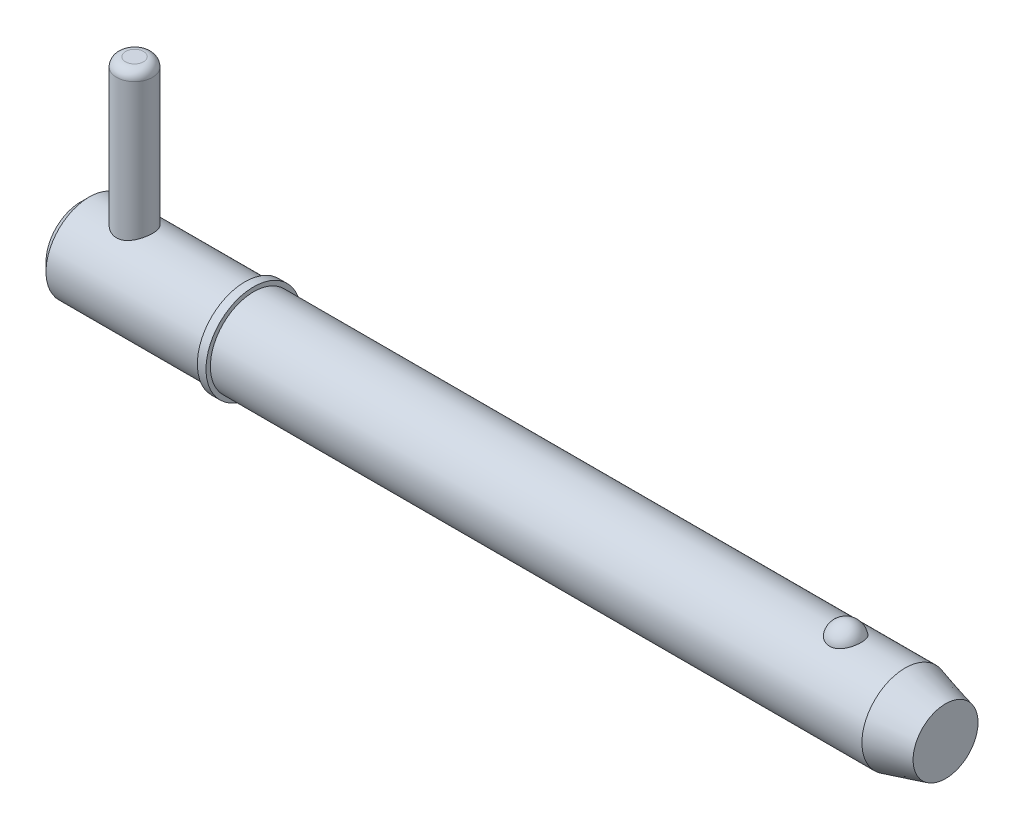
ISO-10303-21;
HEADER;
FILE_DESCRIPTION(('STEP AP214'),'2;1');
FILE_NAME('part.step','',(''),(''),'','','');
FILE_SCHEMA(('AUTOMOTIVE_DESIGN { 1 0 10303 214 1 1 1 1 }'));
ENDSEC;
DATA;
#1=APPLICATION_CONTEXT('core data for automotive mechanical design processes');
#2=APPLICATION_PROTOCOL_DEFINITION('international standard','automotive_design',2000,#1);
#3=PRODUCT_CONTEXT('',#1,'mechanical');
#4=PRODUCT('Part','Part','',(#3));
#5=PRODUCT_RELATED_PRODUCT_CATEGORY('part','',(#4));
#6=PRODUCT_DEFINITION_FORMATION('','',#4);
#7=PRODUCT_DEFINITION_CONTEXT('part definition',#1,'design');
#8=PRODUCT_DEFINITION('design','',#6,#7);
#9=PRODUCT_DEFINITION_SHAPE('','',#8);
#10=(LENGTH_UNIT() NAMED_UNIT(*) SI_UNIT(.MILLI.,.METRE.));
#11=(NAMED_UNIT(*) PLANE_ANGLE_UNIT() SI_UNIT($,.RADIAN.));
#12=(NAMED_UNIT(*) SI_UNIT($,.STERADIAN.) SOLID_ANGLE_UNIT());
#13=UNCERTAINTY_MEASURE_WITH_UNIT(LENGTH_MEASURE(1.E-05),#10,'distance_accuracy_value','');
#14=(GEOMETRIC_REPRESENTATION_CONTEXT(3) GLOBAL_UNCERTAINTY_ASSIGNED_CONTEXT((#13)) GLOBAL_UNIT_ASSIGNED_CONTEXT((#10,
#11,#12)) REPRESENTATION_CONTEXT('',''));
#15=CARTESIAN_POINT('',(0.,0.,0.));
#16=DIRECTION('',(0.,0.,1.));
#17=DIRECTION('',(1.,0.,0.));
#18=AXIS2_PLACEMENT_3D('',#15,#16,#17);
#19=CARTESIAN_POINT('',(5.94,20.635,0.));
#20=DIRECTION('',(0.,-1.,0.));
#21=DIRECTION('',(0.,0.,-1.));
#22=AXIS2_PLACEMENT_3D('',#19,#20,#21);
#23=CYLINDRICAL_SURFACE('',#22,1.98);
#24=CARTESIAN_POINT('',(5.94,-3.775,0.));
#25=DIRECTION('',(0.,1.,0.));
#26=DIRECTION('',(0.,0.,1.));
#27=AXIS2_PLACEMENT_3D('',#24,#25,#26);
#28=CIRCLE('',#27,1.98);
#29=CARTESIAN_POINT('',(5.94,-3.775,1.98));
#30=VERTEX_POINT('',#29);
#31=EDGE_CURVE('P0_E25',#30,#30,#28,.T.);
#32=ORIENTED_EDGE('',*,*,#31,.T.);
#33=EDGE_LOOP('',(#32));
#34=FACE_BOUND('',#33,.T.);
#35=CARTESIAN_POINT('',(5.94,19.645,0.));
#36=DIRECTION('',(0.,1.,0.));
#37=DIRECTION('',(0.,0.,1.));
#38=AXIS2_PLACEMENT_3D('',#35,#36,#37);
#39=CIRCLE('',#38,1.98);
#40=CARTESIAN_POINT('',(5.94,19.645,1.98));
#41=VERTEX_POINT('',#40);
#42=EDGE_CURVE('P0_E29',#41,#41,#39,.F.);
#43=ORIENTED_EDGE('',*,*,#42,.T.);
#44=EDGE_LOOP('',(#43));
#45=FACE_BOUND('',#44,.T.);
#46=ADVANCED_FACE('P0_F14',(#34,#45),#23,.T.);
#47=CARTESIAN_POINT('',(5.94,20.635,0.));
#48=DIRECTION('',(0.,1.,0.));
#49=DIRECTION('',(0.,0.,1.));
#50=AXIS2_PLACEMENT_3D('',#47,#48,#49);
#51=PLANE('',#50);
#52=CARTESIAN_POINT('',(5.94,20.635,0.));
#53=DIRECTION('',(0.,1.,0.));
#54=DIRECTION('',(0.,0.,1.));
#55=AXIS2_PLACEMENT_3D('',#52,#53,#54);
#56=CIRCLE('',#55,0.99);
#57=CARTESIAN_POINT('',(5.94,20.635,0.99));
#58=VERTEX_POINT('',#57);
#59=EDGE_CURVE('P0_E10',#58,#58,#56,.T.);
#60=ORIENTED_EDGE('',*,*,#59,.T.);
#61=EDGE_LOOP('',(#60));
#62=FACE_BOUND('',#61,.T.);
#63=ADVANCED_FACE('P0_F46',(#62),#51,.T.);
#64=CARTESIAN_POINT('',(5.94,-4.765,0.));
#65=DIRECTION('',(0.,1.,0.));
#66=DIRECTION('',(0.,0.,1.));
#67=AXIS2_PLACEMENT_3D('',#64,#65,#66);
#68=PLANE('',#67);
#69=CARTESIAN_POINT('',(5.94,-4.765,0.));
#70=DIRECTION('',(0.,1.,0.));
#71=DIRECTION('',(0.,0.,1.));
#72=AXIS2_PLACEMENT_3D('',#69,#70,#71);
#73=CIRCLE('',#72,0.99);
#74=CARTESIAN_POINT('',(5.94,-4.765,0.99));
#75=VERTEX_POINT('',#74);
#76=EDGE_CURVE('P0_E21',#75,#75,#73,.F.);
#77=ORIENTED_EDGE('',*,*,#76,.T.);
#78=EDGE_LOOP('',(#77));
#79=FACE_BOUND('',#78,.T.);
#80=ADVANCED_FACE('P0_F43',(#79),#68,.F.);
#81=CARTESIAN_POINT('',(5.94,-3.775,0.));
#82=DIRECTION('',(0.,1.,0.));
#83=DIRECTION('',(0.,0.,1.));
#84=AXIS2_PLACEMENT_3D('',#81,#82,#83);
#85=DEGENERATE_TOROIDAL_SURFACE('',#84,0.99,0.99,.T.);
#86=ORIENTED_EDGE('',*,*,#76,.F.);
#87=EDGE_LOOP('',(#86));
#88=FACE_BOUND('',#87,.T.);
#89=ORIENTED_EDGE('',*,*,#31,.F.);
#90=EDGE_LOOP('',(#89));
#91=FACE_BOUND('',#90,.T.);
#92=ADVANCED_FACE('P0_F38',(#88,#91),#85,.T.);
#93=CARTESIAN_POINT('',(5.94,19.645,0.));
#94=DIRECTION('',(0.,1.,0.));
#95=DIRECTION('',(0.,0.,1.));
#96=AXIS2_PLACEMENT_3D('',#93,#94,#95);
#97=DEGENERATE_TOROIDAL_SURFACE('',#96,0.99,0.99,.T.);
#98=ORIENTED_EDGE('',*,*,#42,.F.);
#99=EDGE_LOOP('',(#98));
#100=FACE_BOUND('',#99,.T.);
#101=ORIENTED_EDGE('',*,*,#59,.F.);
#102=EDGE_LOOP('',(#101));
#103=FACE_BOUND('',#102,.T.);
#104=ADVANCED_FACE('P0_F16',(#100,#103),#97,.T.);
#105=CLOSED_SHELL('',(#46,#63,#80,#92,#104));
#106=MANIFOLD_SOLID_BREP('P0_B1',#105);
#107=CARTESIAN_POINT('',(0.,0.,0.));
#108=DIRECTION('',(1.,0.,0.));
#109=DIRECTION('',(0.,0.,-1.));
#110=AXIS2_PLACEMENT_3D('',#107,#108,#109);
#111=CYLINDRICAL_SURFACE('',#110,4.765);
#112=CARTESIAN_POINT('',(90.8041944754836,0.,0.));
#113=DIRECTION('',(1.,0.,0.));
#114=DIRECTION('',(0.,0.,-1.));
#115=AXIS2_PLACEMENT_3D('',#112,#113,#114);
#116=CIRCLE('',#115,4.765);
#117=CARTESIAN_POINT('',(90.8041944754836,0.,-4.765));
#118=VERTEX_POINT('',#117);
#119=EDGE_CURVE('P1_E81',#118,#118,#116,.T.);
#120=ORIENTED_EDGE('',*,*,#119,.F.);
#121=EDGE_LOOP('',(#120));
#122=FACE_BOUND('',#121,.T.);
#123=CARTESIAN_POINT('',(19.05,0.,0.));
#124=DIRECTION('',(1.,0.,0.));
#125=DIRECTION('',(0.,0.,-1.));
#126=AXIS2_PLACEMENT_3D('',#123,#124,#125);
#127=CIRCLE('',#126,4.765);
#128=CARTESIAN_POINT('',(19.05,0.,-4.765));
#129=VERTEX_POINT('',#128);
#130=EDGE_CURVE('P1_E85',#129,#129,#127,.T.);
#131=ORIENTED_EDGE('',*,*,#130,.T.);
#132=EDGE_LOOP('',(#131));
#133=FACE_BOUND('',#132,.T.);
#134=CARTESIAN_POINT('',(84.251020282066,4.42764777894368,1.76101111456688));
#135=CARTESIAN_POINT('',(84.1597212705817,4.42764470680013,1.76101422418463));
#136=CARTESIAN_POINT('',(84.0684468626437,4.43059091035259,1.75366340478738));
#137=CARTESIAN_POINT('',(83.8886154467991,4.44201846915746,1.72451180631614));
#138=CARTESIAN_POINT('',(83.8000577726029,4.45049845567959,1.70271460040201));
#139=CARTESIAN_POINT('',(83.6282570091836,4.47200516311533,1.6453937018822));
#140=CARTESIAN_POINT('',(83.5450064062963,4.48502527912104,1.60988994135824));
#141=CARTESIAN_POINT('',(83.3857633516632,4.51419542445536,1.52617873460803));
#142=CARTESIAN_POINT('',(83.3097723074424,4.53034605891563,1.47796883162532));
#143=CARTESIAN_POINT('',(83.1647445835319,4.5645931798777,1.36860494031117));
#144=CARTESIAN_POINT('',(83.0959645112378,4.58273170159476,1.30712420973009));
#145=CARTESIAN_POINT('',(82.9693423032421,4.61870302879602,1.17370204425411));
#146=CARTESIAN_POINT('',(82.9115021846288,4.63653577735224,1.10175868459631));
#147=CARTESIAN_POINT('',(82.8055709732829,4.67090140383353,0.945806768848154));
#148=CARTESIAN_POINT('',(82.7580305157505,4.68734068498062,0.861402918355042));
#149=CARTESIAN_POINT('',(82.6770817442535,4.71628466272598,0.685442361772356));
#150=CARTESIAN_POINT('',(82.6436747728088,4.72878898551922,0.593884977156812));
#151=CARTESIAN_POINT('',(82.591287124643,4.74874061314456,0.404781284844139));
#152=CARTESIAN_POINT('',(82.5725178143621,4.75611366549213,0.307168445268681));
#153=CARTESIAN_POINT('',(82.5505846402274,4.76475393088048,0.109940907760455));
#154=CARTESIAN_POINT('',(82.5474205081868,4.76602124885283,0.0103262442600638));
#155=CARTESIAN_POINT('',(82.5567405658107,4.76232928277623,-0.187629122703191));
#156=CARTESIAN_POINT('',(82.5691588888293,4.7573962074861,-0.285973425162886));
#157=CARTESIAN_POINT('',(82.6092804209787,4.74184975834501,-0.479027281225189));
#158=CARTESIAN_POINT('',(82.6369839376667,4.7312362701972,-0.573736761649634));
#159=CARTESIAN_POINT('',(82.7071581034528,4.70540026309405,-0.756973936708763));
#160=CARTESIAN_POINT('',(82.7496460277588,4.69017235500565,-0.845494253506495));
#161=CARTESIAN_POINT('',(82.848520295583,4.6566986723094,-1.01378033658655));
#162=CARTESIAN_POINT('',(82.9049076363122,4.63845268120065,-1.09354547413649));
#163=CARTESIAN_POINT('',(83.030552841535,4.60085438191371,-1.24228523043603));
#164=CARTESIAN_POINT('',(83.0998439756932,4.58149930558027,-1.31123108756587));
#165=CARTESIAN_POINT('',(83.2496066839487,4.54391653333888,-1.43607409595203));
#166=CARTESIAN_POINT('',(83.3300771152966,4.52568872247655,-1.49197257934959));
#167=CARTESIAN_POINT('',(83.4981500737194,4.49293007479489,-1.58786764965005));
#168=CARTESIAN_POINT('',(83.5855445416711,4.47832346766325,-1.62820219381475));
#169=CARTESIAN_POINT('',(83.766553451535,4.45406011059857,-1.69345757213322));
#170=CARTESIAN_POINT('',(83.8601655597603,4.44440151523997,-1.71838415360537));
#171=CARTESIAN_POINT('',(84.0458939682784,4.43159888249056,-1.75112843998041));
#172=CARTESIAN_POINT('',(84.137849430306,4.42815213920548,-1.75974223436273));
#173=CARTESIAN_POINT('',(84.3219658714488,4.427247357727,-1.76201865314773));
#174=CARTESIAN_POINT('',(84.4141268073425,4.42978816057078,-1.7556841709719));
#175=CARTESIAN_POINT('',(84.5931292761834,4.4403864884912,-1.72869560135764));
#176=CARTESIAN_POINT('',(84.6800474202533,4.44827555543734,-1.70847853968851));
#177=CARTESIAN_POINT('',(84.8491314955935,4.46852246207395,-1.65479562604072));
#178=CARTESIAN_POINT('',(84.9312970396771,4.48088066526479,-1.62132869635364));
#179=CARTESIAN_POINT('',(85.0905916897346,4.50907357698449,-1.54120560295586));
#180=CARTESIAN_POINT('',(85.1675700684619,4.52497884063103,-1.49427526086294));
#181=CARTESIAN_POINT('',(85.3127080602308,4.55845148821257,-1.38881222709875));
#182=CARTESIAN_POINT('',(85.3808656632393,4.57601924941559,-1.33027689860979));
#183=CARTESIAN_POINT('',(85.5100990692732,4.61196537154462,-1.19991049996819));
#184=CARTESIAN_POINT('',(85.5706562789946,4.63034074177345,-1.12756415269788));
#185=CARTESIAN_POINT('',(85.6792797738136,4.66513959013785,-0.973612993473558));
#186=CARTESIAN_POINT('',(85.7273438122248,4.68156271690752,-0.892006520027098));
#187=CARTESIAN_POINT('',(85.811383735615,4.71130224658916,-0.718892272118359));
#188=CARTESIAN_POINT('',(85.8469185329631,4.724501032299,-0.627149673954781));
#189=CARTESIAN_POINT('',(85.9029522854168,4.74571823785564,-0.438611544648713));
#190=CARTESIAN_POINT('',(85.923450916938,4.75373654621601,-0.341815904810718));
#191=CARTESIAN_POINT('',(85.9490338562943,4.76378905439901,-0.145633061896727));
#192=CARTESIAN_POINT('',(85.954076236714,4.76580697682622,-0.0462395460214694));
#193=CARTESIAN_POINT('',(85.9485239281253,4.76360573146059,0.152038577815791));
#194=CARTESIAN_POINT('',(85.9379294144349,4.75938663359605,0.250923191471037));
#195=CARTESIAN_POINT('',(85.9013875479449,4.74516937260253,0.445004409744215));
#196=CARTESIAN_POINT('',(85.8754964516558,4.73519238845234,0.540213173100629));
#197=CARTESIAN_POINT('',(85.8089273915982,4.7104939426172,0.724662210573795));
#198=CARTESIAN_POINT('',(85.768248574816,4.69577220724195,0.813902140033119));
#199=CARTESIAN_POINT('',(85.6727177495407,4.66303767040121,0.984313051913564));
#200=CARTESIAN_POINT('',(85.6178042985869,4.64501070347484,1.06544688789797));
#201=CARTESIAN_POINT('',(85.4950496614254,4.60764678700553,1.21692673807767));
#202=CARTESIAN_POINT('',(85.4272086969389,4.58830985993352,1.2872729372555));
#203=CARTESIAN_POINT('',(85.2805480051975,4.55060370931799,1.41479271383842));
#204=CARTESIAN_POINT('',(85.2017918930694,4.53222967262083,1.4720378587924));
#205=CARTESIAN_POINT('',(85.0349890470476,4.49849576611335,1.57212016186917));
#206=CARTESIAN_POINT('',(84.9469417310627,4.48313608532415,1.61495641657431));
#207=CARTESIAN_POINT('',(84.7597918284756,4.45676184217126,1.68642657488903));
#208=CARTESIAN_POINT('',(84.6603653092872,4.44598302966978,1.71430590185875));
#209=CARTESIAN_POINT('',(84.4576210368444,4.43142918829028,1.75159258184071));
#210=CARTESIAN_POINT('',(84.3543049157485,4.42765125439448,1.76100759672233));
#211=CARTESIAN_POINT('',(84.251020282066,4.42764777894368,1.76101111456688));
#212=B_SPLINE_CURVE_WITH_KNOTS('',3,(#134,#135,#136,#137,#138,#139,#140,#141,#142,#143,#144,
#145,#146,#147,#148,#149,#150,#151,#152,#153,#154,#155,#156,#157,#158,#159,#160,#161,#162,#163,
#164,#165,#166,#167,#168,#169,#170,#171,#172,#173,#174,#175,#176,#177,#178,#179,#180,#181,#182,
#183,#184,#185,#186,#187,#188,#189,#190,#191,#192,#193,#194,#195,#196,#197,#198,#199,#200,#201,
#202,#203,#204,#205,#206,#207,#208,#209,#210,#211),.UNSPECIFIED.,.T.,.F.,(4,2,2,2,2,2,2,2,2,2,2,
2,2,2,2,2,2,2,2,2,2,2,2,2,2,2,2,2,2,2,2,2,2,2,2,2,2,2,4),(0.,0.273517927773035,
0.546968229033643,0.820022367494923,1.09312934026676,1.37393946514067,1.65480131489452,
1.94820420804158,2.24163496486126,2.53922817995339,2.8368162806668,3.13315071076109,
3.42949110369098,3.72617893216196,4.02288805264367,4.32037303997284,4.61782764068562,
4.90840095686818,5.19886582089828,5.4747485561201,5.75057789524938,6.01809977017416,
6.2856434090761,6.55907787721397,6.83257454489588,7.11962987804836,7.40673679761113,
7.70312663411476,7.99952284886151,8.29672237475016,8.59391856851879,8.89002850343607,
9.18615552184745,9.483582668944,9.78100471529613,10.0767610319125,10.3725358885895,
10.6820893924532,10.991514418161),.UNSPECIFIED.);
#213=CARTESIAN_POINT('',(84.251020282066,4.42764777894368,1.76101111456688));
#214=VERTEX_POINT('',#213);
#215=EDGE_CURVE('P1_E35',#214,#214,#212,.T.);
#216=ORIENTED_EDGE('',*,*,#215,.T.);
#217=EDGE_LOOP('',(#216));
#218=FACE_BOUND('',#217,.T.);
#219=ADVANCED_FACE('P1_F13',(#122,#133,#218),#111,.T.);
#220=CARTESIAN_POINT('',(0.,0.,0.));
#221=DIRECTION('',(-1.,0.,0.));
#222=DIRECTION('',(0.,0.,1.));
#223=AXIS2_PLACEMENT_3D('',#220,#221,#222);
#224=PLANE('',#223);
#225=CARTESIAN_POINT('',(0.,0.,0.));
#226=DIRECTION('',(1.,0.,0.));
#227=DIRECTION('',(0.,0.,-1.));
#228=AXIS2_PLACEMENT_3D('',#225,#226,#227);
#229=CIRCLE('',#228,3.812);
#230=CARTESIAN_POINT('',(0.,0.,-3.812));
#231=VERTEX_POINT('',#230);
#232=EDGE_CURVE('P1_E9',#231,#231,#229,.T.);
#233=ORIENTED_EDGE('',*,*,#232,.F.);
#234=EDGE_LOOP('',(#233));
#235=FACE_BOUND('',#234,.T.);
#236=ADVANCED_FACE('P1_F15',(#235),#224,.T.);
#237=CARTESIAN_POINT('',(0.952999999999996,0.,0.));
#238=DIRECTION('',(1.,0.,0.));
#239=DIRECTION('',(0.,0.,-1.));
#240=AXIS2_PLACEMENT_3D('',#237,#238,#239);
#241=CONICAL_SURFACE('',#240,4.765,0.78539816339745);
#242=ORIENTED_EDGE('',*,*,#232,.T.);
#243=EDGE_LOOP('',(#242));
#244=FACE_BOUND('',#243,.T.);
#245=CARTESIAN_POINT('',(0.952999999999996,0.,0.));
#246=DIRECTION('',(1.,0.,0.));
#247=DIRECTION('',(0.,0.,-1.));
#248=AXIS2_PLACEMENT_3D('',#245,#246,#247);
#249=CIRCLE('',#248,4.765);
#250=CARTESIAN_POINT('',(0.952999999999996,0.,-4.765));
#251=VERTEX_POINT('',#250);
#252=EDGE_CURVE('P1_E26',#251,#251,#249,.T.);
#253=ORIENTED_EDGE('',*,*,#252,.F.);
#254=EDGE_LOOP('',(#253));
#255=FACE_BOUND('',#254,.T.);
#256=ADVANCED_FACE('P1_F77',(#244,#255),#241,.T.);
#257=CARTESIAN_POINT('',(0.,0.,0.));
#258=DIRECTION('',(1.,0.,0.));
#259=DIRECTION('',(0.,0.,-1.));
#260=AXIS2_PLACEMENT_3D('',#257,#258,#259);
#261=CYLINDRICAL_SURFACE('',#260,4.765);
#262=CARTESIAN_POINT('',(5.94,-4.33414639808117,1.98));
#263=CARTESIAN_POINT('',(5.83435484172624,-4.33415447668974,1.97999169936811));
#264=CARTESIAN_POINT('',(5.72854887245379,-4.33806396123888,1.97149330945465));
#265=CARTESIAN_POINT('',(5.51998191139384,-4.35319906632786,1.93783487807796));
#266=CARTESIAN_POINT('',(5.41723000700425,-4.3644446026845,1.91262947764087));
#267=CARTESIAN_POINT('',(5.21817294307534,-4.39274225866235,1.84670269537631));
#268=CARTESIAN_POINT('',(5.12184344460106,-4.40977076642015,1.80604432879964));
#269=CARTESIAN_POINT('',(4.93740039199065,-4.44768106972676,1.71055160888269));
#270=CARTESIAN_POINT('',(4.84928487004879,-4.46856193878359,1.65572066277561));
#271=CARTESIAN_POINT('',(4.67826533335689,-4.51326966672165,1.52981120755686));
#272=CARTESIAN_POINT('',(4.59593118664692,-4.53719608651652,1.45799365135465));
#273=CARTESIAN_POINT('',(4.44405452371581,-4.58448035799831,1.30170177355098));
#274=CARTESIAN_POINT('',(4.37451692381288,-4.60783798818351,1.21722260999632));
#275=CARTESIAN_POINT('',(4.24730683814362,-4.65256187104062,1.03353484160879));
#276=CARTESIAN_POINT('',(4.19027484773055,-4.67379892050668,0.933848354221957));
#277=CARTESIAN_POINT('',(4.0940363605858,-4.7106711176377,0.7252544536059));
#278=CARTESIAN_POINT('',(4.05482199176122,-4.72630873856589,0.61635113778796));
#279=CARTESIAN_POINT('',(3.99739515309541,-4.74951416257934,0.398397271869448));
#280=CARTESIAN_POINT('',(3.97820018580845,-4.7574579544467,0.289646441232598));
#281=CARTESIAN_POINT('',(3.95818309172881,-4.76574596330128,0.0701967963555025));
#282=CARTESIAN_POINT('',(3.95735355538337,-4.76609324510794,-0.0405012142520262));
#283=CARTESIAN_POINT('',(3.9735743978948,-4.75937098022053,-0.253561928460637));
#284=CARTESIAN_POINT('',(3.98954548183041,-4.75274912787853,-0.356023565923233));
#285=CARTESIAN_POINT('',(4.03706504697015,-4.73344665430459,-0.556659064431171));
#286=CARTESIAN_POINT('',(4.06861467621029,-4.72076558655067,-0.654832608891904));
#287=CARTESIAN_POINT('',(4.14677192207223,-4.69032846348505,-0.845904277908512));
#288=CARTESIAN_POINT('',(4.19360181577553,-4.67249797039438,-0.938699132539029));
#289=CARTESIAN_POINT('',(4.30077315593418,-4.63350852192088,-1.11535616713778));
#290=CARTESIAN_POINT('',(4.3611193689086,-4.61234839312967,-1.19921518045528));
#291=CARTESIAN_POINT('',(4.49853487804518,-4.56707259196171,-1.3618711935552));
#292=CARTESIAN_POINT('',(4.57648039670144,-4.5428537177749,-1.43990029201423));
#293=CARTESIAN_POINT('',(4.74440779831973,-4.49530722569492,-1.58211009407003));
#294=CARTESIAN_POINT('',(4.83439425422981,-4.47197995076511,-1.64628551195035));
#295=CARTESIAN_POINT('',(5.02755026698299,-4.42812342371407,-1.76092221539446));
#296=CARTESIAN_POINT('',(5.13105348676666,-4.40770990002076,-1.81086937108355));
#297=CARTESIAN_POINT('',(5.34607555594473,-4.37336901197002,-1.89231211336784));
#298=CARTESIAN_POINT('',(5.45758864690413,-4.3594370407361,-1.92382080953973));
#299=CARTESIAN_POINT('',(5.67777275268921,-4.34077746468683,-1.96554536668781));
#300=CARTESIAN_POINT('',(5.78616167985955,-4.33551319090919,-1.9770057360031));
#301=CARTESIAN_POINT('',(6.00341835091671,-4.33325118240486,-1.98196183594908));
#302=CARTESIAN_POINT('',(6.11228591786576,-4.33625061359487,-1.97546372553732));
#303=CARTESIAN_POINT('',(6.32012423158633,-4.34962383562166,-1.94582288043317));
#304=CARTESIAN_POINT('',(6.41928436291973,-4.35951709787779,-1.92376364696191));
#305=CARTESIAN_POINT('',(6.61241543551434,-4.38495043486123,-1.86506038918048));
#306=CARTESIAN_POINT('',(6.70638516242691,-4.40049182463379,-1.82841296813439));
#307=CARTESIAN_POINT('',(6.89090272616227,-4.43627016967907,-1.73985559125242));
#308=CARTESIAN_POINT('',(6.98113841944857,-4.45667771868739,-1.68736639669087));
#309=CARTESIAN_POINT('',(7.1519532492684,-4.49964530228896,-1.56919282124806));
#310=CARTESIAN_POINT('',(7.232528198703,-4.52220626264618,-1.50350275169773));
#311=CARTESIAN_POINT('',(7.38851617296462,-4.56914071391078,-1.35452895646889));
#312=CARTESIAN_POINT('',(7.46298462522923,-4.5935132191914,-1.27025197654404));
#313=CARTESIAN_POINT('',(7.59689029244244,-4.63962841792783,-1.08983181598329));
#314=CARTESIAN_POINT('',(7.65632644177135,-4.66137092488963,-0.993687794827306));
#315=CARTESIAN_POINT('',(7.75840361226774,-4.69991192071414,-0.791608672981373));
#316=CARTESIAN_POINT('',(7.80100481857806,-4.71669866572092,-0.685651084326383));
#317=CARTESIAN_POINT('',(7.86746997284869,-4.74331408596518,-0.467197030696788));
#318=CARTESIAN_POINT('',(7.8913450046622,-4.75314687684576,-0.354704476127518));
#319=CARTESIAN_POINT('',(7.91828971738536,-4.76427543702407,-0.134819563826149));
#320=CARTESIAN_POINT('',(7.92269147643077,-4.76611762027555,-0.027616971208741));
#321=CARTESIAN_POINT('',(7.91414154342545,-4.76256684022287,0.185959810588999));
#322=CARTESIAN_POINT('',(7.90119286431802,-4.75717513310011,0.292334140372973));
#323=CARTESIAN_POINT('',(7.85926572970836,-4.74004856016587,0.497383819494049));
#324=CARTESIAN_POINT('',(7.83086647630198,-4.72854322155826,0.596198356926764));
#325=CARTESIAN_POINT('',(7.75947503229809,-4.70045111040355,0.787624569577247));
#326=CARTESIAN_POINT('',(7.71648006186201,-4.68386336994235,0.880235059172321));
#327=CARTESIAN_POINT('',(7.6149456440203,-4.64628321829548,1.06122875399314));
#328=CARTESIAN_POINT('',(7.55579211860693,-4.62512577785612,1.14923242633));
#329=CARTESIAN_POINT('',(7.42451813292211,-4.58091700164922,1.31443888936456));
#330=CARTESIAN_POINT('',(7.35239289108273,-4.5578649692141,1.39163767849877));
#331=CARTESIAN_POINT('',(7.19146107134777,-4.51050832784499,1.53847013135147));
#332=CARTESIAN_POINT('',(7.10185635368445,-4.48622440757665,1.60723941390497));
#333=CARTESIAN_POINT('',(6.91164948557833,-4.44076541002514,1.72888900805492));
#334=CARTESIAN_POINT('',(6.81104124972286,-4.41959206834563,1.78176046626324));
#335=CARTESIAN_POINT('',(6.60181953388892,-4.38318936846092,1.86953227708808));
#336=CARTESIAN_POINT('',(6.49325511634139,-4.3679267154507,1.90453365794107));
#337=CARTESIAN_POINT('',(6.32681512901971,-4.35102038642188,1.94268459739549));
#338=CARTESIAN_POINT('',(6.27079191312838,-4.34638447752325,1.953006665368));
#339=CARTESIAN_POINT('',(6.15793999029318,-4.33925923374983,1.96879053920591));
#340=CARTESIAN_POINT('',(6.10111188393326,-4.33676837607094,1.97425579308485));
#341=CARTESIAN_POINT('',(6.00947316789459,-4.33456308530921,1.97908711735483));
#342=CARTESIAN_POINT('',(5.97474528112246,-4.33414374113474,1.98000272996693));
#343=CARTESIAN_POINT('',(5.94,-4.33414639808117,1.98));
#344=B_SPLINE_CURVE_WITH_KNOTS('',3,(#262,#263,#264,#265,#266,#267,#268,#269,#270,#271,#272,
#273,#274,#275,#276,#277,#278,#279,#280,#281,#282,#283,#284,#285,#286,#287,#288,#289,#290,#291,
#292,#293,#294,#295,#296,#297,#298,#299,#300,#301,#302,#303,#304,#305,#306,#307,#308,#309,#310,
#311,#312,#313,#314,#315,#316,#317,#318,#319,#320,#321,#322,#323,#324,#325,#326,#327,#328,#329,
#330,#331,#332,#333,#334,#335,#336,#337,#338,#339,#340,#341,#342,#343),.UNSPECIFIED.,.T.,.F.,(4,
2,2,2,2,2,2,2,2,2,2,2,2,2,2,2,2,2,2,2,2,2,2,2,2,2,2,2,2,2,2,2,2,2,2,2,2,2,2,2,4),(0.,
0.316814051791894,0.634491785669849,0.950887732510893,1.2672076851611,1.60127705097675,
1.93547449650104,2.28407463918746,2.63252061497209,2.96292077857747,3.29318763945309,
3.60346227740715,3.91375978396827,4.22878888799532,4.54392926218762,4.88117914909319,
5.21855748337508,5.56691259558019,5.91501972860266,6.24062939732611,6.56612741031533,
6.87094948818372,7.17584258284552,7.49361276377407,7.81152017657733,8.15513975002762,
8.4987836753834,8.8432355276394,9.18748334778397,9.50777781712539,9.8280166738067,
10.1370037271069,10.4460496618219,10.7690461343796,11.0921619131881,11.4371238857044,
11.7822776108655,12.1254577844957,12.2967183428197,12.4678572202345,12.5720531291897),.UNSPECIFIED.);
#345=CARTESIAN_POINT('',(5.94,-4.33414639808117,1.98));
#346=VERTEX_POINT('',#345);
#347=EDGE_CURVE('P1_E17',#346,#346,#344,.T.);
#348=ORIENTED_EDGE('',*,*,#347,.F.);
#349=EDGE_LOOP('',(#348));
#350=FACE_BOUND('',#349,.T.);
#351=CARTESIAN_POINT('',(5.94,4.33414639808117,1.98));
#352=CARTESIAN_POINT('',(6.04564515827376,4.33415447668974,1.97999169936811));
#353=CARTESIAN_POINT('',(6.15145112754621,4.33806396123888,1.97149330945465));
#354=CARTESIAN_POINT('',(6.36001808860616,4.35319906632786,1.93783487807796));
#355=CARTESIAN_POINT('',(6.46276999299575,4.3644446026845,1.91262947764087));
#356=CARTESIAN_POINT('',(6.66182705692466,4.39274225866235,1.84670269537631));
#357=CARTESIAN_POINT('',(6.75815655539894,4.40977076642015,1.80604432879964));
#358=CARTESIAN_POINT('',(6.94259960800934,4.44768106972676,1.71055160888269));
#359=CARTESIAN_POINT('',(7.03071512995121,4.46856193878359,1.65572066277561));
#360=CARTESIAN_POINT('',(7.20173466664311,4.51326966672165,1.52981120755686));
#361=CARTESIAN_POINT('',(7.28406881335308,4.53719608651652,1.45799365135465));
#362=CARTESIAN_POINT('',(7.43594547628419,4.58448035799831,1.30170177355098));
#363=CARTESIAN_POINT('',(7.50548307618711,4.60783798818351,1.21722260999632));
#364=CARTESIAN_POINT('',(7.63269316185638,4.65256187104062,1.03353484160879));
#365=CARTESIAN_POINT('',(7.68972515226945,4.67379892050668,0.933848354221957));
#366=CARTESIAN_POINT('',(7.7859636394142,4.7106711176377,0.7252544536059));
#367=CARTESIAN_POINT('',(7.82517800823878,4.72630873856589,0.61635113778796));
#368=CARTESIAN_POINT('',(7.88260484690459,4.74951416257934,0.398397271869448));
#369=CARTESIAN_POINT('',(7.90179981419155,4.7574579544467,0.289646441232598));
#370=CARTESIAN_POINT('',(7.92181690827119,4.76574596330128,0.0701967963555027));
#371=CARTESIAN_POINT('',(7.92264644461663,4.76609324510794,-0.040501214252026));
#372=CARTESIAN_POINT('',(7.9064256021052,4.75937098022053,-0.253561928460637));
#373=CARTESIAN_POINT('',(7.89045451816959,4.75274912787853,-0.356023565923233));
#374=CARTESIAN_POINT('',(7.84293495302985,4.73344665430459,-0.55665906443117));
#375=CARTESIAN_POINT('',(7.81138532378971,4.72076558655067,-0.654832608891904));
#376=CARTESIAN_POINT('',(7.73322807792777,4.69032846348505,-0.845904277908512));
#377=CARTESIAN_POINT('',(7.68639818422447,4.67249797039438,-0.938699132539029));
#378=CARTESIAN_POINT('',(7.57922684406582,4.63350852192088,-1.11535616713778));
#379=CARTESIAN_POINT('',(7.5188806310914,4.61234839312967,-1.19921518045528));
#380=CARTESIAN_POINT('',(7.38146512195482,4.56707259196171,-1.3618711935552));
#381=CARTESIAN_POINT('',(7.30351960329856,4.5428537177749,-1.43990029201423));
#382=CARTESIAN_POINT('',(7.13559220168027,4.49530722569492,-1.58211009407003));
#383=CARTESIAN_POINT('',(7.04560574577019,4.47197995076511,-1.64628551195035));
#384=CARTESIAN_POINT('',(6.85244973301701,4.42812342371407,-1.76092221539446));
#385=CARTESIAN_POINT('',(6.74894651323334,4.40770990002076,-1.81086937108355));
#386=CARTESIAN_POINT('',(6.53392444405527,4.37336901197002,-1.89231211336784));
#387=CARTESIAN_POINT('',(6.42241135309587,4.3594370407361,-1.92382080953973));
#388=CARTESIAN_POINT('',(6.20222724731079,4.34077746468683,-1.96554536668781));
#389=CARTESIAN_POINT('',(6.09383832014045,4.33551319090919,-1.9770057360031));
#390=CARTESIAN_POINT('',(5.87658164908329,4.33325118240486,-1.98196183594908));
#391=CARTESIAN_POINT('',(5.76771408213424,4.33625061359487,-1.97546372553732));
#392=CARTESIAN_POINT('',(5.55987576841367,4.34962383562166,-1.94582288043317));
#393=CARTESIAN_POINT('',(5.46071563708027,4.35951709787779,-1.92376364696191));
#394=CARTESIAN_POINT('',(5.26758456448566,4.38495043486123,-1.86506038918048));
#395=CARTESIAN_POINT('',(5.17361483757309,4.40049182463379,-1.82841296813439));
#396=CARTESIAN_POINT('',(4.98909727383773,4.43627016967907,-1.73985559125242));
#397=CARTESIAN_POINT('',(4.89886158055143,4.45667771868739,-1.68736639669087));
#398=CARTESIAN_POINT('',(4.72804675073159,4.49964530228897,-1.56919282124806));
#399=CARTESIAN_POINT('',(4.647471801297,4.52220626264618,-1.50350275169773));
#400=CARTESIAN_POINT('',(4.49148382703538,4.56914071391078,-1.35452895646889));
#401=CARTESIAN_POINT('',(4.41701537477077,4.5935132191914,-1.27025197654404));
#402=CARTESIAN_POINT('',(4.28310970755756,4.63962841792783,-1.08983181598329));
#403=CARTESIAN_POINT('',(4.22367355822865,4.66137092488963,-0.993687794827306));
#404=CARTESIAN_POINT('',(4.12159638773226,4.69991192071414,-0.791608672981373));
#405=CARTESIAN_POINT('',(4.07899518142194,4.71669866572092,-0.685651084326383));
#406=CARTESIAN_POINT('',(4.01253002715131,4.74331408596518,-0.467197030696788));
#407=CARTESIAN_POINT('',(3.98865499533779,4.75314687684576,-0.354704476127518));
#408=CARTESIAN_POINT('',(3.96171028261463,4.76427543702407,-0.134819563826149));
#409=CARTESIAN_POINT('',(3.95730852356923,4.76611762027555,-0.0276169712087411));
#410=CARTESIAN_POINT('',(3.96585845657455,4.76256684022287,0.185959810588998));
#411=CARTESIAN_POINT('',(3.97880713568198,4.75717513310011,0.292334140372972));
#412=CARTESIAN_POINT('',(4.02073427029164,4.74004856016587,0.497383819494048));
#413=CARTESIAN_POINT('',(4.04913352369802,4.72854322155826,0.596198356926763));
#414=CARTESIAN_POINT('',(4.12052496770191,4.70045111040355,0.787624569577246));
#415=CARTESIAN_POINT('',(4.16351993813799,4.68386336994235,0.880235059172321));
#416=CARTESIAN_POINT('',(4.2650543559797,4.64628321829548,1.06122875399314));
#417=CARTESIAN_POINT('',(4.32420788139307,4.62512577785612,1.14923242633));
#418=CARTESIAN_POINT('',(4.45548186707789,4.58091700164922,1.31443888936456));
#419=CARTESIAN_POINT('',(4.52760710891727,4.5578649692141,1.39163767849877));
#420=CARTESIAN_POINT('',(4.68853892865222,4.51050832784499,1.53847013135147));
#421=CARTESIAN_POINT('',(4.77814364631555,4.48622440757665,1.60723941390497));
#422=CARTESIAN_POINT('',(4.96835051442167,4.44076541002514,1.72888900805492));
#423=CARTESIAN_POINT('',(5.06895875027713,4.41959206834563,1.78176046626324));
#424=CARTESIAN_POINT('',(5.27818046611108,4.38318936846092,1.86953227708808));
#425=CARTESIAN_POINT('',(5.38674488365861,4.3679267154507,1.90453365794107));
#426=CARTESIAN_POINT('',(5.55318487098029,4.35102038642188,1.94268459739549));
#427=CARTESIAN_POINT('',(5.60920808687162,4.34638447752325,1.953006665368));
#428=CARTESIAN_POINT('',(5.72206000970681,4.33925923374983,1.96879053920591));
#429=CARTESIAN_POINT('',(5.77888811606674,4.33676837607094,1.97425579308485));
#430=CARTESIAN_POINT('',(5.87052683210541,4.33456308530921,1.97908711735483));
#431=CARTESIAN_POINT('',(5.90525471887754,4.33414374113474,1.98000272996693));
#432=CARTESIAN_POINT('',(5.94,4.33414639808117,1.98));
#433=B_SPLINE_CURVE_WITH_KNOTS('',3,(#351,#352,#353,#354,#355,#356,#357,#358,#359,#360,#361,
#362,#363,#364,#365,#366,#367,#368,#369,#370,#371,#372,#373,#374,#375,#376,#377,#378,#379,#380,
#381,#382,#383,#384,#385,#386,#387,#388,#389,#390,#391,#392,#393,#394,#395,#396,#397,#398,#399,
#400,#401,#402,#403,#404,#405,#406,#407,#408,#409,#410,#411,#412,#413,#414,#415,#416,#417,#418,
#419,#420,#421,#422,#423,#424,#425,#426,#427,#428,#429,#430,#431,#432),.UNSPECIFIED.,.T.,.F.,(4,
2,2,2,2,2,2,2,2,2,2,2,2,2,2,2,2,2,2,2,2,2,2,2,2,2,2,2,2,2,2,2,2,2,2,2,2,2,2,2,4),(0.,
0.316814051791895,0.634491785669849,0.950887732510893,1.2672076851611,1.60127705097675,
1.93547449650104,2.28407463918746,2.63252061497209,2.96292077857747,3.29318763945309,
3.60346227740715,3.91375978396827,4.22878888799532,4.54392926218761,4.88117914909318,
5.21855748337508,5.56691259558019,5.91501972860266,6.24062939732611,6.56612741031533,
6.87094948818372,7.17584258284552,7.49361276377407,7.81152017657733,8.15513975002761,
8.4987836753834,8.84323552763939,9.18748334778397,9.50777781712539,9.8280166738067,
10.1370037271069,10.4460496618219,10.7690461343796,11.0921619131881,11.4371238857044,
11.7822776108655,12.1254577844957,12.2967183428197,12.4678572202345,12.5720531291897),.UNSPECIFIED.);
#434=CARTESIAN_POINT('',(5.94,4.33414639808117,1.98));
#435=VERTEX_POINT('',#434);
#436=EDGE_CURVE('P1_E43',#435,#435,#433,.T.);
#437=ORIENTED_EDGE('',*,*,#436,.F.);
#438=EDGE_LOOP('',(#437));
#439=FACE_BOUND('',#438,.T.);
#440=ORIENTED_EDGE('',*,*,#252,.T.);
#441=EDGE_LOOP('',(#440));
#442=FACE_BOUND('',#441,.T.);
#443=CARTESIAN_POINT('',(18.097,0.,0.));
#444=DIRECTION('',(1.,0.,0.));
#445=DIRECTION('',(0.,0.,-1.));
#446=AXIS2_PLACEMENT_3D('',#443,#444,#445);
#447=CIRCLE('',#446,4.765);
#448=CARTESIAN_POINT('',(18.097,0.,-4.765));
#449=VERTEX_POINT('',#448);
#450=EDGE_CURVE('P1_E31',#449,#449,#447,.T.);
#451=ORIENTED_EDGE('',*,*,#450,.F.);
#452=EDGE_LOOP('',(#451));
#453=FACE_BOUND('',#452,.T.);
#454=ADVANCED_FACE('P1_F103',(#350,#439,#442,#453),#261,.T.);
#455=CARTESIAN_POINT('',(18.097,4.765,0.));
#456=DIRECTION('',(-1.,0.,0.));
#457=DIRECTION('',(0.,0.,1.));
#458=AXIS2_PLACEMENT_3D('',#455,#456,#457);
#459=PLANE('',#458);
#460=ORIENTED_EDGE('',*,*,#450,.T.);
#461=EDGE_LOOP('',(#460));
#462=FACE_BOUND('',#461,.T.);
#463=CARTESIAN_POINT('',(18.097,0.,0.));
#464=DIRECTION('',(1.,0.,0.));
#465=DIRECTION('',(0.,0.,-1.));
#466=AXIS2_PLACEMENT_3D('',#463,#464,#465);
#467=CIRCLE('',#466,5.2415);
#468=CARTESIAN_POINT('',(18.097,0.,-5.2415));
#469=VERTEX_POINT('',#468);
#470=EDGE_CURVE('P1_E91',#469,#469,#467,.T.);
#471=ORIENTED_EDGE('',*,*,#470,.F.);
#472=EDGE_LOOP('',(#471));
#473=FACE_BOUND('',#472,.T.);
#474=ADVANCED_FACE('P1_F100',(#462,#473),#459,.T.);
#475=CARTESIAN_POINT('',(0.,0.,0.));
#476=DIRECTION('',(1.,0.,0.));
#477=DIRECTION('',(0.,0.,-1.));
#478=AXIS2_PLACEMENT_3D('',#475,#476,#477);
#479=CYLINDRICAL_SURFACE('',#478,5.2415);
#480=ORIENTED_EDGE('',*,*,#470,.T.);
#481=EDGE_LOOP('',(#480));
#482=FACE_BOUND('',#481,.T.);
#483=CARTESIAN_POINT('',(19.05,0.,0.));
#484=DIRECTION('',(1.,0.,0.));
#485=DIRECTION('',(0.,0.,-1.));
#486=AXIS2_PLACEMENT_3D('',#483,#484,#485);
#487=CIRCLE('',#486,5.2415);
#488=CARTESIAN_POINT('',(19.05,0.,-5.2415));
#489=VERTEX_POINT('',#488);
#490=EDGE_CURVE('P1_E88',#489,#489,#487,.T.);
#491=ORIENTED_EDGE('',*,*,#490,.F.);
#492=EDGE_LOOP('',(#491));
#493=FACE_BOUND('',#492,.T.);
#494=ADVANCED_FACE('P1_F68',(#482,#493),#479,.T.);
#495=CARTESIAN_POINT('',(19.05,5.2415,0.));
#496=DIRECTION('',(1.,0.,0.));
#497=DIRECTION('',(0.,0.,-1.));
#498=AXIS2_PLACEMENT_3D('',#495,#496,#497);
#499=PLANE('',#498);
#500=ORIENTED_EDGE('',*,*,#490,.T.);
#501=EDGE_LOOP('',(#500));
#502=FACE_BOUND('',#501,.T.);
#503=ORIENTED_EDGE('',*,*,#130,.F.);
#504=EDGE_LOOP('',(#503));
#505=FACE_BOUND('',#504,.T.);
#506=ADVANCED_FACE('P1_F62',(#502,#505),#499,.T.);
#507=CARTESIAN_POINT('',(95.25,0.,0.));
#508=DIRECTION('',(-1.,0.,0.));
#509=DIRECTION('',(0.,0.,1.));
#510=AXIS2_PLACEMENT_3D('',#507,#508,#509);
#511=CONICAL_SURFACE('',#510,3.57375000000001,0.261799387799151);
#512=ORIENTED_EDGE('',*,*,#119,.T.);
#513=EDGE_LOOP('',(#512));
#514=FACE_BOUND('',#513,.T.);
#515=CARTESIAN_POINT('',(95.25,0.,0.));
#516=DIRECTION('',(1.,0.,0.));
#517=DIRECTION('',(0.,0.,-1.));
#518=AXIS2_PLACEMENT_3D('',#515,#516,#517);
#519=CIRCLE('',#518,3.57375000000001);
#520=CARTESIAN_POINT('',(95.25,0.,-3.57375000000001));
#521=VERTEX_POINT('',#520);
#522=EDGE_CURVE('P1_E42',#521,#521,#519,.T.);
#523=ORIENTED_EDGE('',*,*,#522,.F.);
#524=EDGE_LOOP('',(#523));
#525=FACE_BOUND('',#524,.T.);
#526=ADVANCED_FACE('P1_F59',(#514,#525),#511,.T.);
#527=CARTESIAN_POINT('',(95.25,3.57375000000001,0.));
#528=DIRECTION('',(1.,0.,0.));
#529=DIRECTION('',(0.,0.,-1.));
#530=AXIS2_PLACEMENT_3D('',#527,#528,#529);
#531=PLANE('',#530);
#532=ORIENTED_EDGE('',*,*,#522,.T.);
#533=EDGE_LOOP('',(#532));
#534=FACE_BOUND('',#533,.T.);
#535=ADVANCED_FACE('P1_F55',(#534),#531,.T.);
#536=CARTESIAN_POINT('',(84.251020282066,4.2885,0.));
#537=DIRECTION('',(-1.,0.,0.));
#538=DIRECTION('',(0.,1.,0.));
#539=AXIS2_PLACEMENT_3D('',#536,#537,#538);
#540=SPHERICAL_SURFACE('',#539,1.7665);
#541=ORIENTED_EDGE('',*,*,#215,.F.);
#542=EDGE_LOOP('',(#541));
#543=FACE_BOUND('',#542,.T.);
#544=ADVANCED_FACE('P1_F50',(#543),#540,.T.);
#545=CARTESIAN_POINT('',(5.94,-5.2415,0.));
#546=DIRECTION('',(0.,1.,0.));
#547=DIRECTION('',(0.,0.,1.));
#548=AXIS2_PLACEMENT_3D('',#545,#546,#547);
#549=CYLINDRICAL_SURFACE('',#548,1.98);
#550=ORIENTED_EDGE('',*,*,#347,.T.);
#551=EDGE_LOOP('',(#550));
#552=FACE_BOUND('',#551,.T.);
#553=ORIENTED_EDGE('',*,*,#436,.T.);
#554=EDGE_LOOP('',(#553));
#555=FACE_BOUND('',#554,.T.);
#556=ADVANCED_FACE('P1_F54',(#552,#555),#549,.F.);
#557=CLOSED_SHELL('',(#219,#236,#256,#454,#474,#494,#506,#526,#535,#544,#556));
#558=MANIFOLD_SOLID_BREP('P1_B1',#557);
#559=ADVANCED_BREP_SHAPE_REPRESENTATION('',(#18,#106,#558),#14);
#560=SHAPE_DEFINITION_REPRESENTATION(#9,#559);
ENDSEC;
END-ISO-10303-21;
